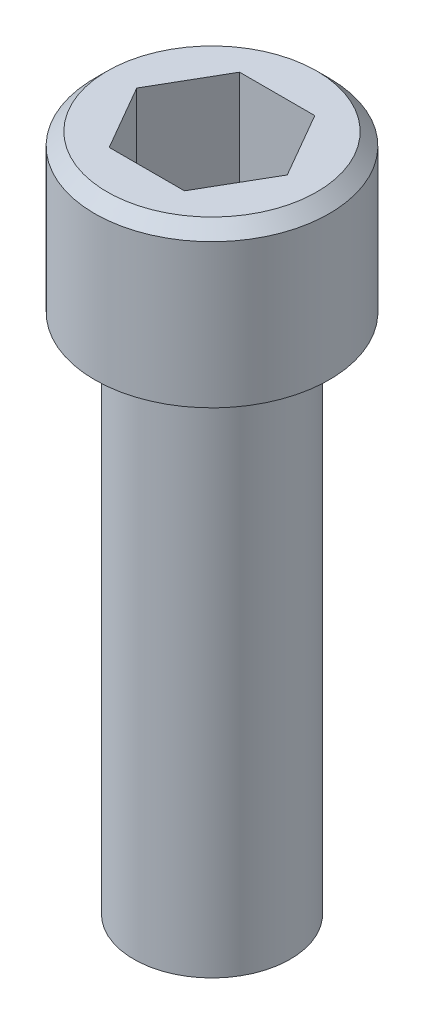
ISO-10303-21;
HEADER;
FILE_DESCRIPTION(('STEP AP214'),'2;1');
FILE_NAME('part.step','',(''),(''),'','','');
FILE_SCHEMA(('AUTOMOTIVE_DESIGN { 1 0 10303 214 1 1 1 1 }'));
ENDSEC;
DATA;
#1=APPLICATION_CONTEXT('core data for automotive mechanical design processes');
#2=APPLICATION_PROTOCOL_DEFINITION('international standard','automotive_design',2000,#1);
#3=PRODUCT_CONTEXT('',#1,'mechanical');
#4=PRODUCT('Part','Part','',(#3));
#5=PRODUCT_RELATED_PRODUCT_CATEGORY('part','',(#4));
#6=PRODUCT_DEFINITION_FORMATION('','',#4);
#7=PRODUCT_DEFINITION_CONTEXT('part definition',#1,'design');
#8=PRODUCT_DEFINITION('design','',#6,#7);
#9=PRODUCT_DEFINITION_SHAPE('','',#8);
#10=(LENGTH_UNIT() NAMED_UNIT(*) SI_UNIT(.MILLI.,.METRE.));
#11=(NAMED_UNIT(*) PLANE_ANGLE_UNIT() SI_UNIT($,.RADIAN.));
#12=(NAMED_UNIT(*) SI_UNIT($,.STERADIAN.) SOLID_ANGLE_UNIT());
#13=UNCERTAINTY_MEASURE_WITH_UNIT(LENGTH_MEASURE(1.E-05),#10,'distance_accuracy_value','');
#14=(GEOMETRIC_REPRESENTATION_CONTEXT(3) GLOBAL_UNCERTAINTY_ASSIGNED_CONTEXT((#13)) GLOBAL_UNIT_ASSIGNED_CONTEXT((#10,
#11,#12)) REPRESENTATION_CONTEXT('',''));
#15=CARTESIAN_POINT('',(0.,0.,0.));
#16=DIRECTION('',(0.,0.,1.));
#17=DIRECTION('',(1.,0.,0.));
#18=AXIS2_PLACEMENT_3D('',#15,#16,#17);
#19=CARTESIAN_POINT('',(0.,0.,0.));
#20=DIRECTION('',(0.,-1.,0.));
#21=DIRECTION('',(0.,0.,-1.));
#22=AXIS2_PLACEMENT_3D('',#19,#20,#21);
#23=CYLINDRICAL_SURFACE('',#22,7.14375);
#24=CARTESIAN_POINT('',(0.,8.76299999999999,0.));
#25=DIRECTION('',(0.,1.,0.));
#26=DIRECTION('',(0.,0.,1.));
#27=AXIS2_PLACEMENT_3D('',#24,#25,#26);
#28=CIRCLE('',#27,7.14375);
#29=CARTESIAN_POINT('',(0.,8.76299999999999,-7.14375));
#30=VERTEX_POINT('',#29);
#31=EDGE_CURVE('E37',#30,#30,#28,.F.);
#32=ORIENTED_EDGE('',*,*,#31,.T.);
#33=EDGE_LOOP('',(#32));
#34=FACE_BOUND('',#33,.T.);
#35=CARTESIAN_POINT('',(0.,0.,0.));
#36=DIRECTION('',(0.,-1.,0.));
#37=DIRECTION('',(0.,0.,-1.));
#38=AXIS2_PLACEMENT_3D('',#35,#36,#37);
#39=CIRCLE('',#38,7.14375);
#40=CARTESIAN_POINT('',(0.,0.,-7.14375));
#41=VERTEX_POINT('',#40);
#42=EDGE_CURVE('E129',#41,#41,#39,.T.);
#43=ORIENTED_EDGE('',*,*,#42,.F.);
#44=EDGE_LOOP('',(#43));
#45=FACE_BOUND('',#44,.T.);
#46=ADVANCED_FACE('F30',(#34,#45),#23,.T.);
#47=CARTESIAN_POINT('',(7.14375,9.525,0.));
#48=DIRECTION('',(0.,1.,0.));
#49=DIRECTION('',(0.,0.,1.));
#50=AXIS2_PLACEMENT_3D('',#47,#48,#49);
#51=PLANE('',#50);
#52=CARTESIAN_POINT('',(0.,9.525,0.));
#53=DIRECTION('',(0.,1.,0.));
#54=DIRECTION('',(0.,0.,1.));
#55=AXIS2_PLACEMENT_3D('',#52,#53,#54);
#56=CIRCLE('',#55,6.38174999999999);
#57=CARTESIAN_POINT('',(0.,9.525,-6.38174999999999));
#58=VERTEX_POINT('',#57);
#59=EDGE_CURVE('E11',#58,#58,#56,.T.);
#60=ORIENTED_EDGE('',*,*,#59,.T.);
#61=EDGE_LOOP('',(#60));
#62=FACE_BOUND('',#61,.T.);
#63=DIRECTION('',(1.,0.,0.));
#64=VECTOR('',#63,1.);
#65=CARTESIAN_POINT('',(-2.29135888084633,9.525,3.96875));
#66=LINE('',#65,#64);
#67=CARTESIAN_POINT('',(-2.29135888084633,9.525,3.96875));
#68=VERTEX_POINT('',#67);
#69=CARTESIAN_POINT('',(2.29135888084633,9.525,3.96875));
#70=VERTEX_POINT('',#69);
#71=EDGE_CURVE('E44',#68,#70,#66,.T.);
#72=ORIENTED_EDGE('',*,*,#71,.F.);
#73=DIRECTION('',(0.5,0.,0.866025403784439));
#74=VECTOR('',#73,1.);
#75=CARTESIAN_POINT('',(-4.58271776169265,9.525,0.));
#76=LINE('',#75,#74);
#77=CARTESIAN_POINT('',(-4.58271776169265,9.525,0.));
#78=VERTEX_POINT('',#77);
#79=EDGE_CURVE('E113',#78,#68,#76,.T.);
#80=ORIENTED_EDGE('',*,*,#79,.F.);
#81=DIRECTION('',(0.5,0.,-0.866025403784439));
#82=VECTOR('',#81,1.);
#83=CARTESIAN_POINT('',(-4.58271776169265,9.525,0.));
#84=LINE('',#83,#82);
#85=CARTESIAN_POINT('',(-2.29135888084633,9.525,-3.96875));
#86=VERTEX_POINT('',#85);
#87=EDGE_CURVE('E108',#78,#86,#84,.T.);
#88=ORIENTED_EDGE('',*,*,#87,.T.);
#89=DIRECTION('',(1.,0.,0.));
#90=VECTOR('',#89,1.);
#91=CARTESIAN_POINT('',(-2.29135888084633,9.525,-3.96875));
#92=LINE('',#91,#90);
#93=CARTESIAN_POINT('',(2.29135888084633,9.525,-3.96875));
#94=VERTEX_POINT('',#93);
#95=EDGE_CURVE('E106',#86,#94,#92,.T.);
#96=ORIENTED_EDGE('',*,*,#95,.T.);
#97=DIRECTION('',(-0.5,0.,-0.866025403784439));
#98=VECTOR('',#97,1.);
#99=CARTESIAN_POINT('',(4.58271776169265,9.525,0.));
#100=LINE('',#99,#98);
#101=CARTESIAN_POINT('',(4.58271776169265,9.525,0.));
#102=VERTEX_POINT('',#101);
#103=EDGE_CURVE('E89',#102,#94,#100,.T.);
#104=ORIENTED_EDGE('',*,*,#103,.F.);
#105=DIRECTION('',(-0.5,0.,0.866025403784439));
#106=VECTOR('',#105,1.);
#107=CARTESIAN_POINT('',(4.58271776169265,9.525,0.));
#108=LINE('',#107,#106);
#109=EDGE_CURVE('E99',#102,#70,#108,.T.);
#110=ORIENTED_EDGE('',*,*,#109,.T.);
#111=EDGE_LOOP('',(#72,#80,#88,#96,#104,#110));
#112=FACE_BOUND('',#111,.T.);
#113=ADVANCED_FACE('F103',(#62,#112),#51,.T.);
#114=CARTESIAN_POINT('',(0.,-31.75,0.));
#115=DIRECTION('',(0.,-1.,0.));
#116=DIRECTION('',(0.,0.,-1.));
#117=AXIS2_PLACEMENT_3D('',#114,#115,#116);
#118=PLANE('',#117);
#119=CARTESIAN_POINT('',(0.,-31.75,0.));
#120=DIRECTION('',(0.,-1.,0.));
#121=DIRECTION('',(0.,0.,-1.));
#122=AXIS2_PLACEMENT_3D('',#119,#120,#121);
#123=CIRCLE('',#122,4.7625);
#124=CARTESIAN_POINT('',(0.,-31.75,-4.7625));
#125=VERTEX_POINT('',#124);
#126=EDGE_CURVE('E141',#125,#125,#123,.T.);
#127=ORIENTED_EDGE('',*,*,#126,.T.);
#128=EDGE_LOOP('',(#127));
#129=FACE_BOUND('',#128,.T.);
#130=ADVANCED_FACE('F163',(#129),#118,.T.);
#131=CARTESIAN_POINT('',(0.,0.,0.));
#132=DIRECTION('',(0.,-1.,0.));
#133=DIRECTION('',(0.,0.,-1.));
#134=AXIS2_PLACEMENT_3D('',#131,#132,#133);
#135=CYLINDRICAL_SURFACE('',#134,4.7625);
#136=CARTESIAN_POINT('',(0.,0.,0.));
#137=DIRECTION('',(0.,-1.,0.));
#138=DIRECTION('',(0.,0.,-1.));
#139=AXIS2_PLACEMENT_3D('',#136,#137,#138);
#140=CIRCLE('',#139,4.7625);
#141=CARTESIAN_POINT('',(0.,0.,-4.7625));
#142=VERTEX_POINT('',#141);
#143=EDGE_CURVE('E138',#142,#142,#140,.T.);
#144=ORIENTED_EDGE('',*,*,#143,.T.);
#145=EDGE_LOOP('',(#144));
#146=FACE_BOUND('',#145,.T.);
#147=ORIENTED_EDGE('',*,*,#126,.F.);
#148=EDGE_LOOP('',(#147));
#149=FACE_BOUND('',#148,.T.);
#150=ADVANCED_FACE('F168',(#146,#149),#135,.T.);
#151=CARTESIAN_POINT('',(4.7625,0.,0.));
#152=DIRECTION('',(0.,-1.,0.));
#153=DIRECTION('',(0.,0.,-1.));
#154=AXIS2_PLACEMENT_3D('',#151,#152,#153);
#155=PLANE('',#154);
#156=ORIENTED_EDGE('',*,*,#42,.T.);
#157=EDGE_LOOP('',(#156));
#158=FACE_BOUND('',#157,.T.);
#159=ORIENTED_EDGE('',*,*,#143,.F.);
#160=EDGE_LOOP('',(#159));
#161=FACE_BOUND('',#160,.T.);
#162=ADVANCED_FACE('F174',(#158,#161),#155,.T.);
#163=CARTESIAN_POINT('',(-2.29135888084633,3.175,3.96875));
#164=DIRECTION('',(0.,0.,1.));
#165=DIRECTION('',(1.,0.,0.));
#166=AXIS2_PLACEMENT_3D('',#163,#164,#165);
#167=PLANE('',#166);
#168=ORIENTED_EDGE('',*,*,#71,.T.);
#169=DIRECTION('',(0.,1.,0.));
#170=VECTOR('',#169,1.);
#171=CARTESIAN_POINT('',(2.29135888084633,3.175,3.96875));
#172=LINE('',#171,#170);
#173=CARTESIAN_POINT('',(2.29135888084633,3.175,3.96875));
#174=VERTEX_POINT('',#173);
#175=EDGE_CURVE('E96',#174,#70,#172,.T.);
#176=ORIENTED_EDGE('',*,*,#175,.F.);
#177=DIRECTION('',(1.,0.,0.));
#178=VECTOR('',#177,1.);
#179=CARTESIAN_POINT('',(-2.29135888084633,3.175,3.96875));
#180=LINE('',#179,#178);
#181=CARTESIAN_POINT('',(-2.29135888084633,3.175,3.96875));
#182=VERTEX_POINT('',#181);
#183=EDGE_CURVE('E115',#182,#174,#180,.T.);
#184=ORIENTED_EDGE('',*,*,#183,.F.);
#185=DIRECTION('',(0.,1.,0.));
#186=VECTOR('',#185,1.);
#187=CARTESIAN_POINT('',(-2.29135888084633,3.175,3.96875));
#188=LINE('',#187,#186);
#189=EDGE_CURVE('E51',#182,#68,#188,.T.);
#190=ORIENTED_EDGE('',*,*,#189,.T.);
#191=EDGE_LOOP('',(#168,#176,#184,#190));
#192=FACE_BOUND('',#191,.T.);
#193=ADVANCED_FACE('F178',(#192),#167,.F.);
#194=CARTESIAN_POINT('',(-4.58271776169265,3.175,0.));
#195=DIRECTION('',(-0.866025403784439,0.,0.5));
#196=DIRECTION('',(0.5,0.,0.866025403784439));
#197=AXIS2_PLACEMENT_3D('',#194,#195,#196);
#198=PLANE('',#197);
#199=ORIENTED_EDGE('',*,*,#79,.T.);
#200=ORIENTED_EDGE('',*,*,#189,.F.);
#201=DIRECTION('',(0.5,0.,0.866025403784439));
#202=VECTOR('',#201,1.);
#203=CARTESIAN_POINT('',(-4.58271776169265,3.175,0.));
#204=LINE('',#203,#202);
#205=CARTESIAN_POINT('',(-4.58271776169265,3.175,0.));
#206=VERTEX_POINT('',#205);
#207=EDGE_CURVE('E125',#206,#182,#204,.T.);
#208=ORIENTED_EDGE('',*,*,#207,.F.);
#209=DIRECTION('',(0.,1.,0.));
#210=VECTOR('',#209,1.);
#211=CARTESIAN_POINT('',(-4.58271776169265,3.175,0.));
#212=LINE('',#211,#210);
#213=EDGE_CURVE('E130',#206,#78,#212,.T.);
#214=ORIENTED_EDGE('',*,*,#213,.T.);
#215=EDGE_LOOP('',(#199,#200,#208,#214));
#216=FACE_BOUND('',#215,.T.);
#217=ADVANCED_FACE('F182',(#216),#198,.F.);
#218=CARTESIAN_POINT('',(-4.58271776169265,3.175,0.));
#219=DIRECTION('',(0.866025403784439,0.,0.5));
#220=DIRECTION('',(0.5,0.,-0.866025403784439));
#221=AXIS2_PLACEMENT_3D('',#218,#219,#220);
#222=PLANE('',#221);
#223=ORIENTED_EDGE('',*,*,#87,.F.);
#224=ORIENTED_EDGE('',*,*,#213,.F.);
#225=DIRECTION('',(0.5,0.,-0.866025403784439));
#226=VECTOR('',#225,1.);
#227=CARTESIAN_POINT('',(-4.58271776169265,3.175,0.));
#228=LINE('',#227,#226);
#229=CARTESIAN_POINT('',(-2.29135888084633,3.175,-3.96875));
#230=VERTEX_POINT('',#229);
#231=EDGE_CURVE('E123',#206,#230,#228,.T.);
#232=ORIENTED_EDGE('',*,*,#231,.T.);
#233=DIRECTION('',(0.,1.,0.));
#234=VECTOR('',#233,1.);
#235=CARTESIAN_POINT('',(-2.29135888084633,3.175,-3.96875));
#236=LINE('',#235,#234);
#237=EDGE_CURVE('E132',#230,#86,#236,.T.);
#238=ORIENTED_EDGE('',*,*,#237,.T.);
#239=EDGE_LOOP('',(#223,#224,#232,#238));
#240=FACE_BOUND('',#239,.T.);
#241=ADVANCED_FACE('F190',(#240),#222,.T.);
#242=CARTESIAN_POINT('',(-2.29135888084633,3.175,-3.96875));
#243=DIRECTION('',(0.,0.,1.));
#244=DIRECTION('',(1.,0.,0.));
#245=AXIS2_PLACEMENT_3D('',#242,#243,#244);
#246=PLANE('',#245);
#247=ORIENTED_EDGE('',*,*,#95,.F.);
#248=ORIENTED_EDGE('',*,*,#237,.F.);
#249=DIRECTION('',(1.,0.,0.));
#250=VECTOR('',#249,1.);
#251=CARTESIAN_POINT('',(-2.29135888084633,3.175,-3.96875));
#252=LINE('',#251,#250);
#253=CARTESIAN_POINT('',(2.29135888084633,3.175,-3.96875));
#254=VERTEX_POINT('',#253);
#255=EDGE_CURVE('E121',#230,#254,#252,.T.);
#256=ORIENTED_EDGE('',*,*,#255,.T.);
#257=DIRECTION('',(0.,1.,0.));
#258=VECTOR('',#257,1.);
#259=CARTESIAN_POINT('',(2.29135888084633,3.175,-3.96875));
#260=LINE('',#259,#258);
#261=EDGE_CURVE('E95',#254,#94,#260,.T.);
#262=ORIENTED_EDGE('',*,*,#261,.T.);
#263=EDGE_LOOP('',(#247,#248,#256,#262));
#264=FACE_BOUND('',#263,.T.);
#265=ADVANCED_FACE('F187',(#264),#246,.T.);
#266=CARTESIAN_POINT('',(4.58271776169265,3.175,0.));
#267=DIRECTION('',(0.866025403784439,0.,-0.5));
#268=DIRECTION('',(-0.5,0.,-0.866025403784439));
#269=AXIS2_PLACEMENT_3D('',#266,#267,#268);
#270=PLANE('',#269);
#271=ORIENTED_EDGE('',*,*,#103,.T.);
#272=ORIENTED_EDGE('',*,*,#261,.F.);
#273=DIRECTION('',(-0.5,0.,-0.866025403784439));
#274=VECTOR('',#273,1.);
#275=CARTESIAN_POINT('',(4.58271776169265,3.175,0.));
#276=LINE('',#275,#274);
#277=CARTESIAN_POINT('',(4.58271776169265,3.175,0.));
#278=VERTEX_POINT('',#277);
#279=EDGE_CURVE('E92',#278,#254,#276,.T.);
#280=ORIENTED_EDGE('',*,*,#279,.F.);
#281=DIRECTION('',(0.,1.,0.));
#282=VECTOR('',#281,1.);
#283=CARTESIAN_POINT('',(4.58271776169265,3.175,0.));
#284=LINE('',#283,#282);
#285=EDGE_CURVE('E84',#278,#102,#284,.T.);
#286=ORIENTED_EDGE('',*,*,#285,.T.);
#287=EDGE_LOOP('',(#271,#272,#280,#286));
#288=FACE_BOUND('',#287,.T.);
#289=ADVANCED_FACE('F86',(#288),#270,.F.);
#290=CARTESIAN_POINT('',(4.58271776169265,3.175,0.));
#291=DIRECTION('',(-0.866025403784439,0.,-0.5));
#292=DIRECTION('',(-0.5,0.,0.866025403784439));
#293=AXIS2_PLACEMENT_3D('',#290,#291,#292);
#294=PLANE('',#293);
#295=ORIENTED_EDGE('',*,*,#109,.F.);
#296=ORIENTED_EDGE('',*,*,#285,.F.);
#297=DIRECTION('',(-0.5,0.,0.866025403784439));
#298=VECTOR('',#297,1.);
#299=CARTESIAN_POINT('',(4.58271776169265,3.175,0.));
#300=LINE('',#299,#298);
#301=EDGE_CURVE('E118',#278,#174,#300,.T.);
#302=ORIENTED_EDGE('',*,*,#301,.T.);
#303=ORIENTED_EDGE('',*,*,#175,.T.);
#304=EDGE_LOOP('',(#295,#296,#302,#303));
#305=FACE_BOUND('',#304,.T.);
#306=ADVANCED_FACE('F100',(#305),#294,.T.);
#307=CARTESIAN_POINT('',(2.29135888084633,3.175,3.96875));
#308=DIRECTION('',(0.,-1.,0.));
#309=DIRECTION('',(0.,0.,-1.));
#310=AXIS2_PLACEMENT_3D('',#307,#308,#309);
#311=PLANE('',#310);
#312=ORIENTED_EDGE('',*,*,#183,.T.);
#313=ORIENTED_EDGE('',*,*,#301,.F.);
#314=ORIENTED_EDGE('',*,*,#279,.T.);
#315=ORIENTED_EDGE('',*,*,#255,.F.);
#316=ORIENTED_EDGE('',*,*,#231,.F.);
#317=ORIENTED_EDGE('',*,*,#207,.T.);
#318=EDGE_LOOP('',(#312,#313,#314,#315,#316,#317));
#319=FACE_BOUND('',#318,.T.);
#320=ADVANCED_FACE('F150',(#319),#311,.F.);
#321=CARTESIAN_POINT('',(0.,8.76299999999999,0.));
#322=DIRECTION('',(0.,-1.,0.));
#323=DIRECTION('',(0.,0.,-1.));
#324=AXIS2_PLACEMENT_3D('',#321,#322,#323);
#325=CONICAL_SURFACE('',#324,7.14375,0.785398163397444);
#326=CARTESIAN_POINT('',(0.,9.525,-6.38174999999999));
#327=CARTESIAN_POINT('',(0.,9.5170625,-6.3896875));
#328=CARTESIAN_POINT('',(0.,9.509125,-6.397625));
#329=CARTESIAN_POINT('',(0.,9.49325,-6.41349999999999));
#330=CARTESIAN_POINT('',(0.,9.4853125,-6.42143749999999));
#331=CARTESIAN_POINT('',(0.,9.4694375,-6.43731249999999));
#332=CARTESIAN_POINT('',(0.,9.4615,-6.44524999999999));
#333=CARTESIAN_POINT('',(0.,9.445625,-6.46112499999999));
#334=CARTESIAN_POINT('',(0.,9.4376875,-6.46906249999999));
#335=CARTESIAN_POINT('',(0.,9.4218125,-6.48493749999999));
#336=CARTESIAN_POINT('',(0.,9.413875,-6.492875));
#337=CARTESIAN_POINT('',(0.,9.398,-6.50875));
#338=CARTESIAN_POINT('',(0.,9.3900625,-6.5166875));
#339=CARTESIAN_POINT('',(0.,9.3741875,-6.5325625));
#340=CARTESIAN_POINT('',(0.,9.36625,-6.5405));
#341=CARTESIAN_POINT('',(0.,9.350375,-6.556375));
#342=CARTESIAN_POINT('',(0.,9.3424375,-6.5643125));
#343=CARTESIAN_POINT('',(0.,9.3265625,-6.5801875));
#344=CARTESIAN_POINT('',(0.,9.318625,-6.588125));
#345=CARTESIAN_POINT('',(0.,9.30275,-6.604));
#346=CARTESIAN_POINT('',(0.,9.2948125,-6.6119375));
#347=CARTESIAN_POINT('',(0.,9.2789375,-6.6278125));
#348=CARTESIAN_POINT('',(0.,9.271,-6.63575));
#349=CARTESIAN_POINT('',(0.,9.255125,-6.651625));
#350=CARTESIAN_POINT('',(0.,9.2471875,-6.6595625));
#351=CARTESIAN_POINT('',(0.,9.2313125,-6.6754375));
#352=CARTESIAN_POINT('',(0.,9.223375,-6.683375));
#353=CARTESIAN_POINT('',(0.,9.2075,-6.69925));
#354=CARTESIAN_POINT('',(0.,9.1995625,-6.7071875));
#355=CARTESIAN_POINT('',(0.,9.1836875,-6.7230625));
#356=CARTESIAN_POINT('',(0.,9.17575,-6.731));
#357=CARTESIAN_POINT('',(0.,9.15987499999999,-6.746875));
#358=CARTESIAN_POINT('',(0.,9.1519375,-6.7548125));
#359=CARTESIAN_POINT('',(0.,9.13606249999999,-6.7706875));
#360=CARTESIAN_POINT('',(0.,9.12812499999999,-6.778625));
#361=CARTESIAN_POINT('',(0.,9.11224999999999,-6.7945));
#362=CARTESIAN_POINT('',(0.,9.10431249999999,-6.8024375));
#363=CARTESIAN_POINT('',(0.,9.08843749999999,-6.8183125));
#364=CARTESIAN_POINT('',(0.,9.08049999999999,-6.82625));
#365=CARTESIAN_POINT('',(0.,9.06462499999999,-6.842125));
#366=CARTESIAN_POINT('',(0.,9.05668749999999,-6.8500625));
#367=CARTESIAN_POINT('',(0.,9.04081249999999,-6.8659375));
#368=CARTESIAN_POINT('',(0.,9.03287499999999,-6.873875));
#369=CARTESIAN_POINT('',(0.,9.01699999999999,-6.88975));
#370=CARTESIAN_POINT('',(0.,9.00906249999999,-6.8976875));
#371=CARTESIAN_POINT('',(0.,8.99318749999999,-6.9135625));
#372=CARTESIAN_POINT('',(0.,8.98524999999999,-6.9215));
#373=CARTESIAN_POINT('',(0.,8.96937499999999,-6.937375));
#374=CARTESIAN_POINT('',(0.,8.96143749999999,-6.9453125));
#375=CARTESIAN_POINT('',(0.,8.94556249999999,-6.9611875));
#376=CARTESIAN_POINT('',(0.,8.93762499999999,-6.969125));
#377=CARTESIAN_POINT('',(0.,8.92174999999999,-6.985));
#378=CARTESIAN_POINT('',(0.,8.91381249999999,-6.9929375));
#379=CARTESIAN_POINT('',(0.,8.89793749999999,-7.0088125));
#380=CARTESIAN_POINT('',(0.,8.88999999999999,-7.01675));
#381=CARTESIAN_POINT('',(0.,8.87412499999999,-7.032625));
#382=CARTESIAN_POINT('',(0.,8.86618749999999,-7.0405625));
#383=CARTESIAN_POINT('',(0.,8.85031249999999,-7.0564375));
#384=CARTESIAN_POINT('',(0.,8.84237499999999,-7.064375));
#385=CARTESIAN_POINT('',(0.,8.82649999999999,-7.08025));
#386=CARTESIAN_POINT('',(0.,8.81856249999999,-7.0881875));
#387=CARTESIAN_POINT('',(0.,8.80268749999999,-7.1040625));
#388=CARTESIAN_POINT('',(0.,8.79474999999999,-7.112));
#389=CARTESIAN_POINT('',(0.,8.77887499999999,-7.127875));
#390=CARTESIAN_POINT('',(0.,8.77093749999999,-7.1358125));
#391=CARTESIAN_POINT('',(0.,8.76299999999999,-7.14375));
#392=B_SPLINE_CURVE_WITH_KNOTS('',3,(#326,#327,#328,#329,#330,#331,#332,#333,#334,#335,#336,
#337,#338,#339,#340,#341,#342,#343,#344,#345,#346,#347,#348,#349,#350,#351,#352,#353,#354,#355,
#356,#357,#358,#359,#360,#361,#362,#363,#364,#365,#366,#367,#368,#369,#370,#371,#372,#373,#374,
#375,#376,#377,#378,#379,#380,#381,#382,#383,#384,#385,#386,#387,#388,#389,#390,#391),
.UNSPECIFIED.,.F.,.F.,(4,2,2,2,2,2,2,2,2,2,2,2,2,2,2,2,2,2,2,2,2,2,2,2,2,2,2,2,2,2,2,2,4),(0.,
0.0336759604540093,0.0673519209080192,0.101027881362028,0.134703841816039,0.168379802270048,
0.202055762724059,0.235731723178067,0.269407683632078,0.303083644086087,0.336759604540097,
0.370435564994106,0.404111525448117,0.437787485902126,0.471463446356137,0.505139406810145,
0.538815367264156,0.572491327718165,0.606167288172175,0.639843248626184,0.673519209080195,
0.707195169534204,0.740871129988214,0.774547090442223,0.808223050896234,0.841899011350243,
0.875574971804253,0.909250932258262,0.942926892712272,0.976602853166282,1.01027881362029,
1.0439547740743,1.07763073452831),.UNSPECIFIED.);
#393=EDGE_CURVE('BSEAM148',#58,#30,#392,.T.);
#394=ORIENTED_EDGE('',*,*,#59,.F.);
#395=ORIENTED_EDGE('',*,*,#31,.F.);
#396=ORIENTED_EDGE('',*,*,#393,.T.);
#397=ORIENTED_EDGE('',*,*,#393,.F.);
#398=EDGE_LOOP('',(#394,#396,#395,#397));
#399=FACE_BOUND('',#398,.T.);
#400=ADVANCED_FACE('F148',(#399),#325,.T.);
#401=CLOSED_SHELL('',(#46,#113,#130,#150,#162,#193,#217,#241,#265,#289,#306,#320,#400));
#402=MANIFOLD_SOLID_BREP('B2',#401);
#403=ADVANCED_BREP_SHAPE_REPRESENTATION('',(#18,#402),#14);
#404=SHAPE_DEFINITION_REPRESENTATION(#9,#403);
ENDSEC;
END-ISO-10303-21;
